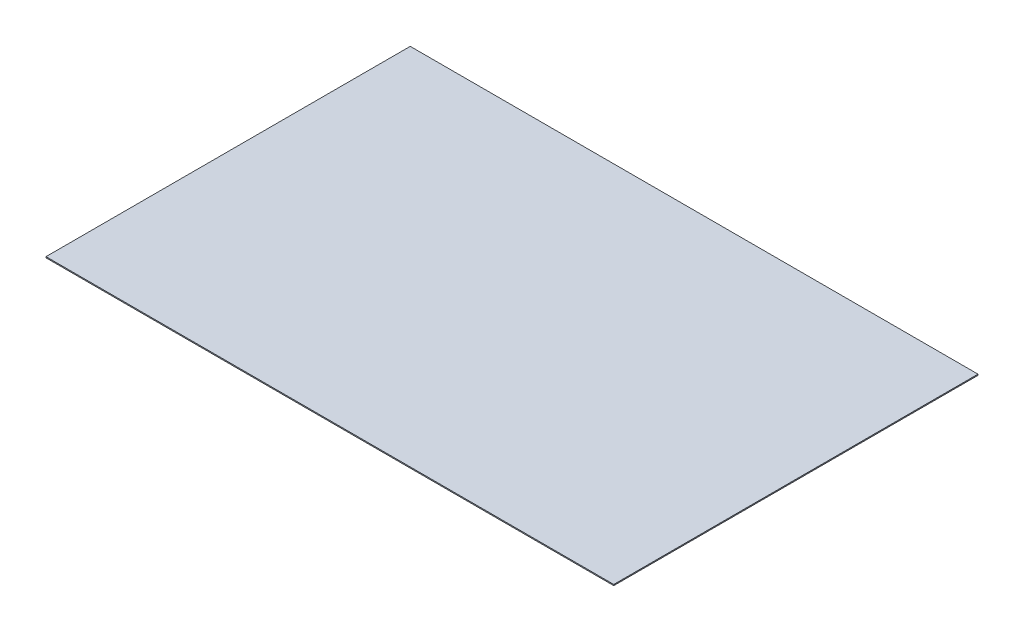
from build123d import *

# Parameters (mm, degrees)
SKETCH1_W           = 1346.2
SKETCH1_H           = 863.6
BOSS_EXTRUDE1_DEPTH = 2.54


with BuildPart() as part:
    # Sketch1 → Boss-Extrude1 (new body)
    with BuildSketch(Plane(origin=(0, 0, 0), x_dir=(1, 0, 0), z_dir=(0, 1, 0))):
        with Locations((540.2833467, -390.185776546)):
            Rectangle(SKETCH1_W, SKETCH1_H)
    extrude(amount=BOSS_EXTRUDE1_DEPTH)


solid = part.part
